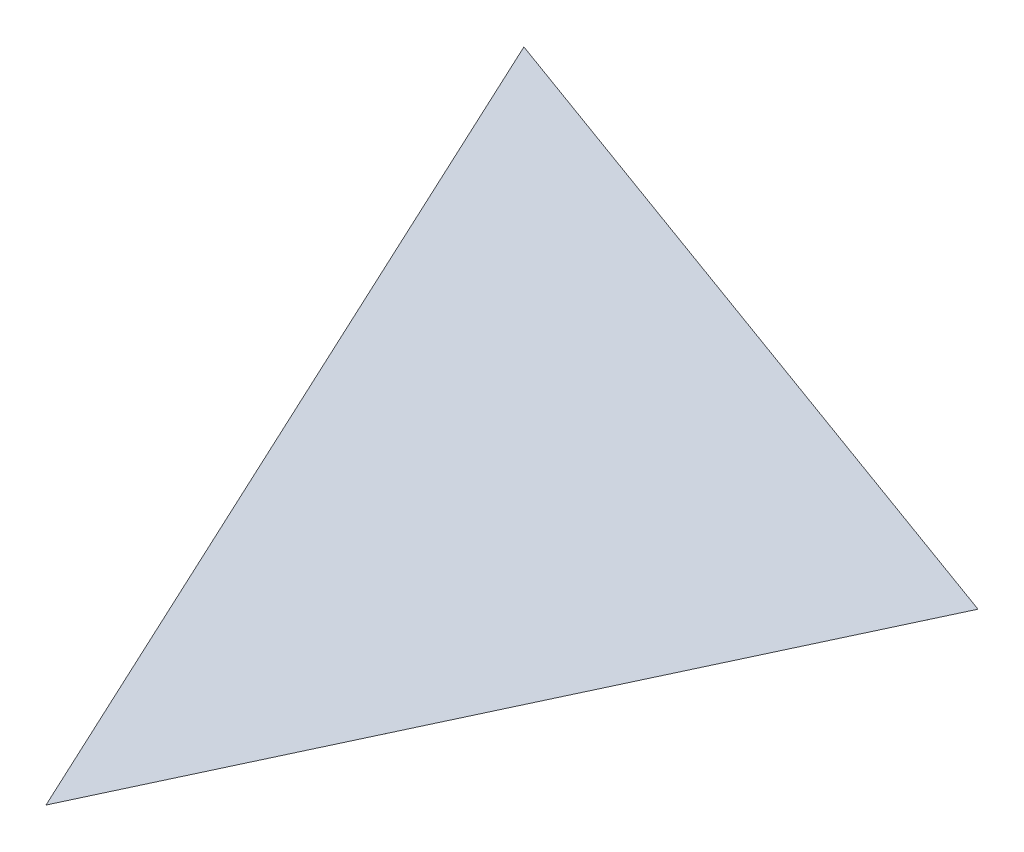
ISO-10303-21;
HEADER;
FILE_DESCRIPTION(('STEP AP214'),'2;1');
FILE_NAME('part.step','',(''),(''),'','','');
FILE_SCHEMA(('AUTOMOTIVE_DESIGN { 1 0 10303 214 1 1 1 1 }'));
ENDSEC;
DATA;
#1=APPLICATION_CONTEXT('core data for automotive mechanical design processes');
#2=APPLICATION_PROTOCOL_DEFINITION('international standard','automotive_design',2000,#1);
#3=PRODUCT_CONTEXT('',#1,'mechanical');
#4=PRODUCT('Part','Part','',(#3));
#5=PRODUCT_RELATED_PRODUCT_CATEGORY('part','',(#4));
#6=PRODUCT_DEFINITION_FORMATION('','',#4);
#7=PRODUCT_DEFINITION_CONTEXT('part definition',#1,'design');
#8=PRODUCT_DEFINITION('design','',#6,#7);
#9=PRODUCT_DEFINITION_SHAPE('','',#8);
#10=(LENGTH_UNIT() NAMED_UNIT(*) SI_UNIT(.MILLI.,.METRE.));
#11=(NAMED_UNIT(*) PLANE_ANGLE_UNIT() SI_UNIT($,.RADIAN.));
#12=(NAMED_UNIT(*) SI_UNIT($,.STERADIAN.) SOLID_ANGLE_UNIT());
#13=UNCERTAINTY_MEASURE_WITH_UNIT(LENGTH_MEASURE(1.E-05),#10,'distance_accuracy_value','');
#14=(GEOMETRIC_REPRESENTATION_CONTEXT(3) GLOBAL_UNCERTAINTY_ASSIGNED_CONTEXT((#13)) GLOBAL_UNIT_ASSIGNED_CONTEXT((#10,
#11,#12)) REPRESENTATION_CONTEXT('',''));
#15=CARTESIAN_POINT('',(0.,0.,0.));
#16=DIRECTION('',(0.,0.,1.));
#17=DIRECTION('',(1.,0.,0.));
#18=AXIS2_PLACEMENT_3D('',#15,#16,#17);
#19=CARTESIAN_POINT('',(0.,0.00127,0.));
#20=DIRECTION('',(0.,1.,0.));
#21=DIRECTION('',(0.,0.,1.));
#22=AXIS2_PLACEMENT_3D('',#19,#20,#21);
#23=PLANE('',#22);
#24=DIRECTION('',(-0.422618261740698,0.,-0.906307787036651));
#25=VECTOR('',#24,1.);
#26=CARTESIAN_POINT('',(0.,0.00127,0.));
#27=LINE('',#26,#25);
#28=CARTESIAN_POINT('',(-2988.36238730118,0.00127,-6408.56382055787));
#29=VERTEX_POINT('',#28);
#30=CARTESIAN_POINT('',(-3.78870463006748E-13,0.00127,9.70360970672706E-13));
#31=VERTEX_POINT('',#30);
#32=EDGE_CURVE('E54',#29,#31,#27,.F.);
#33=ORIENTED_EDGE('',*,*,#32,.T.);
#34=DIRECTION('',(-0.422618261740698,0.,0.906307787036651));
#35=VECTOR('',#34,1.);
#36=CARTESIAN_POINT('',(3730.46126523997,0.00127,-8000.));
#37=LINE('',#36,#35);
#38=CARTESIAN_POINT('',(2121.162974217,0.00127,-4548.84867773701));
#39=VERTEX_POINT('',#38);
#40=EDGE_CURVE('E19',#31,#39,#37,.F.);
#41=ORIENTED_EDGE('',*,*,#40,.T.);
#42=DIRECTION('',(0.939692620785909,0.,0.342020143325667));
#43=VECTOR('',#42,1.);
#44=CARTESIAN_POINT('',(-7360.7973548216,0.00127,-8000.));
#45=LINE('',#44,#43);
#46=EDGE_CURVE('E53',#39,#29,#45,.F.);
#47=ORIENTED_EDGE('',*,*,#46,.T.);
#48=EDGE_LOOP('',(#33,#41,#47));
#49=FACE_BOUND('',#48,.T.);
#50=ADVANCED_FACE('F16',(#49),#23,.T.);
#51=CARTESIAN_POINT('',(3730.46126523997,0.00127,-8000.));
#52=DIRECTION('',(-0.906307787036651,0.,-0.422618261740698));
#53=DIRECTION('',(-0.422618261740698,0.,0.906307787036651));
#54=AXIS2_PLACEMENT_3D('',#51,#52,#53);
#55=PLANE('',#54);
#56=DIRECTION('',(0.,1.,0.));
#57=VECTOR('',#56,1.);
#58=CARTESIAN_POINT('',(2121.162974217,0.00227,-4548.84867773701));
#59=LINE('',#58,#57);
#60=CARTESIAN_POINT('',(2121.162974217,-0.00127,-4548.84867773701));
#61=VERTEX_POINT('',#60);
#62=EDGE_CURVE('E55',#61,#39,#59,.T.);
#63=ORIENTED_EDGE('',*,*,#62,.T.);
#64=ORIENTED_EDGE('',*,*,#40,.F.);
#65=DIRECTION('',(0.,1.,0.));
#66=VECTOR('',#65,1.);
#67=CARTESIAN_POINT('',(0.,0.00127,0.));
#68=LINE('',#67,#66);
#69=CARTESIAN_POINT('',(-3.88578058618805E-13,-0.00127,1.22124532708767E-12));
#70=VERTEX_POINT('',#69);
#71=EDGE_CURVE('E60',#31,#70,#68,.F.);
#72=ORIENTED_EDGE('',*,*,#71,.T.);
#73=DIRECTION('',(0.422618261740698,0.,-0.906307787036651));
#74=VECTOR('',#73,1.);
#75=CARTESIAN_POINT('',(0.,-0.00127,0.));
#76=LINE('',#75,#74);
#77=EDGE_CURVE('E64',#70,#61,#76,.T.);
#78=ORIENTED_EDGE('',*,*,#77,.T.);
#79=EDGE_LOOP('',(#63,#64,#72,#78));
#80=FACE_BOUND('',#79,.T.);
#81=ADVANCED_FACE('F63',(#80),#55,.F.);
#82=CARTESIAN_POINT('',(-7360.7973548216,0.00227,-8000.));
#83=DIRECTION('',(-0.342020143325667,0.,0.939692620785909));
#84=DIRECTION('',(0.939692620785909,0.,0.342020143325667));
#85=AXIS2_PLACEMENT_3D('',#82,#83,#84);
#86=PLANE('',#85);
#87=ORIENTED_EDGE('',*,*,#46,.F.);
#88=ORIENTED_EDGE('',*,*,#62,.F.);
#89=DIRECTION('',(-0.939692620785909,0.,-0.342020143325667));
#90=VECTOR('',#89,1.);
#91=CARTESIAN_POINT('',(2121.162974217,-0.00127,-4548.84867773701));
#92=LINE('',#91,#90);
#93=CARTESIAN_POINT('',(-2988.36238730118,-0.00127,-6408.56382055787));
#94=VERTEX_POINT('',#93);
#95=EDGE_CURVE('E25',#61,#94,#92,.T.);
#96=ORIENTED_EDGE('',*,*,#95,.T.);
#97=DIRECTION('',(0.,1.,0.));
#98=VECTOR('',#97,1.);
#99=CARTESIAN_POINT('',(-2988.36238730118,0.00127,-6408.56382055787));
#100=LINE('',#99,#98);
#101=EDGE_CURVE('E33',#94,#29,#100,.T.);
#102=ORIENTED_EDGE('',*,*,#101,.T.);
#103=EDGE_LOOP('',(#87,#88,#96,#102));
#104=FACE_BOUND('',#103,.T.);
#105=ADVANCED_FACE('F57',(#104),#86,.F.);
#106=CARTESIAN_POINT('',(0.,0.00127,0.));
#107=DIRECTION('',(0.906307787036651,0.,-0.422618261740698));
#108=DIRECTION('',(-0.422618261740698,0.,-0.906307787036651));
#109=AXIS2_PLACEMENT_3D('',#106,#107,#108);
#110=PLANE('',#109);
#111=ORIENTED_EDGE('',*,*,#101,.F.);
#112=DIRECTION('',(0.422618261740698,0.,0.906307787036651));
#113=VECTOR('',#112,1.);
#114=CARTESIAN_POINT('',(-2988.36238730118,-0.00127,-6408.56382055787));
#115=LINE('',#114,#113);
#116=EDGE_CURVE('E11',#94,#70,#115,.T.);
#117=ORIENTED_EDGE('',*,*,#116,.T.);
#118=ORIENTED_EDGE('',*,*,#71,.F.);
#119=ORIENTED_EDGE('',*,*,#32,.F.);
#120=EDGE_LOOP('',(#111,#117,#118,#119));
#121=FACE_BOUND('',#120,.T.);
#122=ADVANCED_FACE('F72',(#121),#110,.F.);
#123=CARTESIAN_POINT('',(0.,-0.00127,0.));
#124=DIRECTION('',(0.,1.,0.));
#125=DIRECTION('',(0.,0.,1.));
#126=AXIS2_PLACEMENT_3D('',#123,#124,#125);
#127=PLANE('',#126);
#128=ORIENTED_EDGE('',*,*,#95,.F.);
#129=ORIENTED_EDGE('',*,*,#77,.F.);
#130=ORIENTED_EDGE('',*,*,#116,.F.);
#131=EDGE_LOOP('',(#128,#129,#130));
#132=FACE_BOUND('',#131,.T.);
#133=ADVANCED_FACE('F71',(#132),#127,.F.);
#134=CLOSED_SHELL('',(#50,#81,#105,#122,#133));
#135=MANIFOLD_SOLID_BREP('B1',#134);
#136=ADVANCED_BREP_SHAPE_REPRESENTATION('',(#18,#135),#14);
#137=SHAPE_DEFINITION_REPRESENTATION(#9,#136);
ENDSEC;
END-ISO-10303-21;
